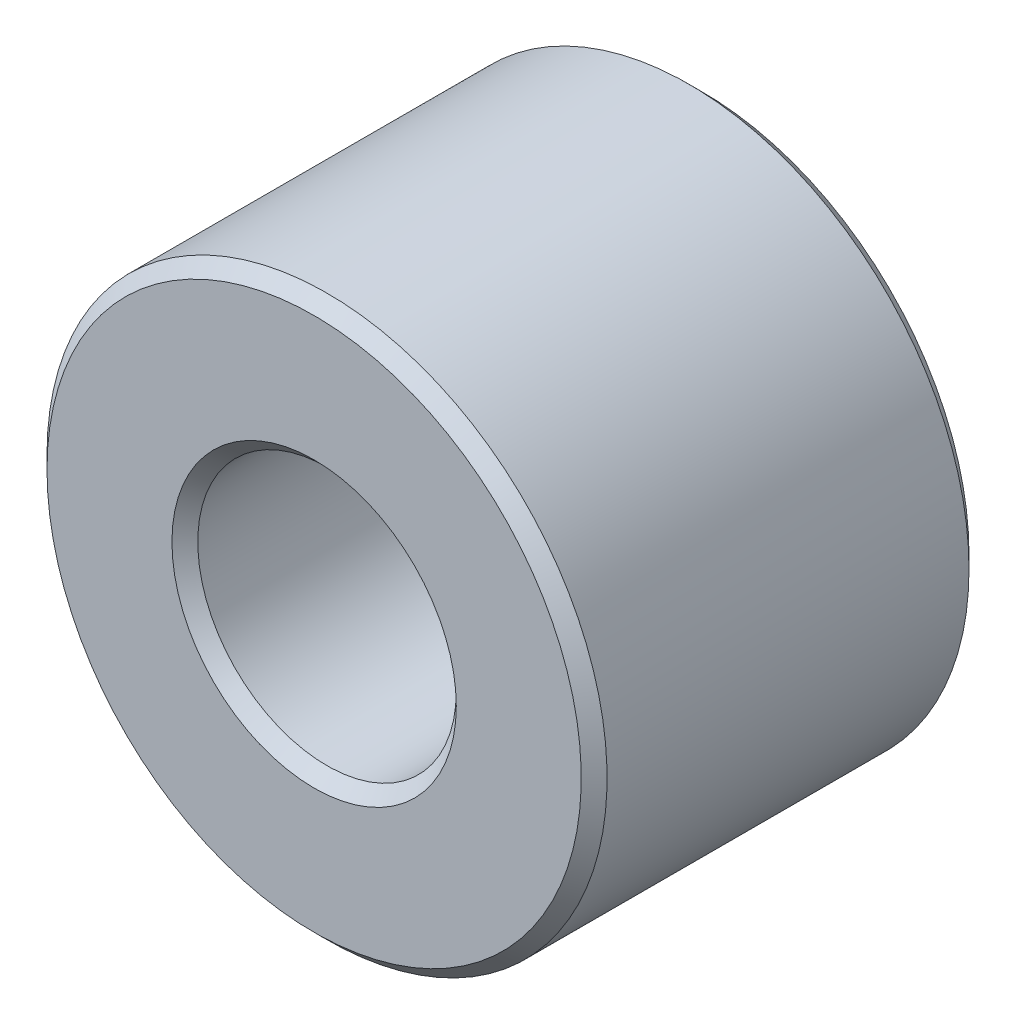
ISO-10303-21;
HEADER;
FILE_DESCRIPTION(('STEP AP214'),'2;1');
FILE_NAME('part.step','',(''),(''),'','','');
FILE_SCHEMA(('AUTOMOTIVE_DESIGN { 1 0 10303 214 1 1 1 1 }'));
ENDSEC;
DATA;
#1=APPLICATION_CONTEXT('core data for automotive mechanical design processes');
#2=APPLICATION_PROTOCOL_DEFINITION('international standard','automotive_design',2000,#1);
#3=PRODUCT_CONTEXT('',#1,'mechanical');
#4=PRODUCT('Part','Part','',(#3));
#5=PRODUCT_RELATED_PRODUCT_CATEGORY('part','',(#4));
#6=PRODUCT_DEFINITION_FORMATION('','',#4);
#7=PRODUCT_DEFINITION_CONTEXT('part definition',#1,'design');
#8=PRODUCT_DEFINITION('design','',#6,#7);
#9=PRODUCT_DEFINITION_SHAPE('','',#8);
#10=(LENGTH_UNIT() NAMED_UNIT(*) SI_UNIT(.MILLI.,.METRE.));
#11=(NAMED_UNIT(*) PLANE_ANGLE_UNIT() SI_UNIT($,.RADIAN.));
#12=(NAMED_UNIT(*) SI_UNIT($,.STERADIAN.) SOLID_ANGLE_UNIT());
#13=UNCERTAINTY_MEASURE_WITH_UNIT(LENGTH_MEASURE(1.E-05),#10,'distance_accuracy_value','');
#14=(GEOMETRIC_REPRESENTATION_CONTEXT(3) GLOBAL_UNCERTAINTY_ASSIGNED_CONTEXT((#13)) GLOBAL_UNIT_ASSIGNED_CONTEXT((#10,
#11,#12)) REPRESENTATION_CONTEXT('',''));
#15=CARTESIAN_POINT('',(0.,0.,0.));
#16=DIRECTION('',(0.,0.,1.));
#17=DIRECTION('',(1.,0.,0.));
#18=AXIS2_PLACEMENT_3D('',#15,#16,#17);
#19=CARTESIAN_POINT('',(0.,0.,9.));
#20=DIRECTION('',(0.,0.,1.));
#21=DIRECTION('',(1.,0.,0.));
#22=AXIS2_PLACEMENT_3D('',#19,#20,#21);
#23=PLANE('',#22);
#24=CARTESIAN_POINT('',(0.,0.,9.));
#25=DIRECTION('',(0.,0.,1.));
#26=DIRECTION('',(1.,0.,0.));
#27=AXIS2_PLACEMENT_3D('',#24,#25,#26);
#28=CIRCLE('',#27,6.6);
#29=CARTESIAN_POINT('',(6.6,0.,9.));
#30=VERTEX_POINT('',#29);
#31=EDGE_CURVE('E10',#30,#30,#28,.F.);
#32=ORIENTED_EDGE('',*,*,#31,.T.);
#33=EDGE_LOOP('',(#32));
#34=FACE_BOUND('',#33,.T.);
#35=CARTESIAN_POINT('',(0.,0.,9.));
#36=DIRECTION('',(0.,0.,1.));
#37=DIRECTION('',(1.,0.,0.));
#38=AXIS2_PLACEMENT_3D('',#35,#36,#37);
#39=CIRCLE('',#38,12.4);
#40=CARTESIAN_POINT('',(-12.4,0.,9.));
#41=VERTEX_POINT('',#40);
#42=EDGE_CURVE('E45',#41,#41,#39,.T.);
#43=ORIENTED_EDGE('',*,*,#42,.T.);
#44=EDGE_LOOP('',(#43));
#45=FACE_BOUND('',#44,.T.);
#46=ADVANCED_FACE('F37',(#34,#45),#23,.T.);
#47=CARTESIAN_POINT('',(0.,0.,-9.));
#48=DIRECTION('',(0.,0.,1.));
#49=DIRECTION('',(1.,0.,0.));
#50=AXIS2_PLACEMENT_3D('',#47,#48,#49);
#51=PLANE('',#50);
#52=CARTESIAN_POINT('',(0.,0.,-9.));
#53=DIRECTION('',(0.,0.,1.));
#54=DIRECTION('',(1.,0.,0.));
#55=AXIS2_PLACEMENT_3D('',#52,#53,#54);
#56=CIRCLE('',#55,6.6);
#57=CARTESIAN_POINT('',(6.6,0.,-9.));
#58=VERTEX_POINT('',#57);
#59=EDGE_CURVE('E70',#58,#58,#56,.T.);
#60=ORIENTED_EDGE('',*,*,#59,.T.);
#61=EDGE_LOOP('',(#60));
#62=FACE_BOUND('',#61,.T.);
#63=CARTESIAN_POINT('',(0.,0.,-9.));
#64=DIRECTION('',(0.,0.,1.));
#65=DIRECTION('',(1.,0.,0.));
#66=AXIS2_PLACEMENT_3D('',#63,#64,#65);
#67=CIRCLE('',#66,12.4);
#68=CARTESIAN_POINT('',(12.4,0.,-9.));
#69=VERTEX_POINT('',#68);
#70=EDGE_CURVE('E74',#69,#69,#67,.F.);
#71=ORIENTED_EDGE('',*,*,#70,.T.);
#72=EDGE_LOOP('',(#71));
#73=FACE_BOUND('',#72,.T.);
#74=ADVANCED_FACE('F78',(#62,#73),#51,.F.);
#75=CARTESIAN_POINT('',(0.,0.,9.));
#76=DIRECTION('',(0.,0.,-1.));
#77=DIRECTION('',(-1.,0.,0.));
#78=AXIS2_PLACEMENT_3D('',#75,#76,#77);
#79=CYLINDRICAL_SURFACE('',#78,13.);
#80=CARTESIAN_POINT('',(0.,0.,-8.4));
#81=DIRECTION('',(0.,0.,1.));
#82=DIRECTION('',(1.,0.,0.));
#83=AXIS2_PLACEMENT_3D('',#80,#81,#82);
#84=CIRCLE('',#83,13.);
#85=CARTESIAN_POINT('',(13.,0.,-8.4));
#86=VERTEX_POINT('',#85);
#87=EDGE_CURVE('E52',#86,#86,#84,.T.);
#88=ORIENTED_EDGE('',*,*,#87,.T.);
#89=EDGE_LOOP('',(#88));
#90=FACE_BOUND('',#89,.T.);
#91=CARTESIAN_POINT('',(0.,0.,8.4));
#92=DIRECTION('',(0.,0.,1.));
#93=DIRECTION('',(1.,0.,0.));
#94=AXIS2_PLACEMENT_3D('',#91,#92,#93);
#95=CIRCLE('',#94,13.);
#96=CARTESIAN_POINT('',(-13.,0.,8.4));
#97=VERTEX_POINT('',#96);
#98=EDGE_CURVE('E58',#97,#97,#95,.F.);
#99=ORIENTED_EDGE('',*,*,#98,.T.);
#100=EDGE_LOOP('',(#99));
#101=FACE_BOUND('',#100,.T.);
#102=ADVANCED_FACE('F88',(#90,#101),#79,.T.);
#103=CARTESIAN_POINT('',(0.,0.,9.));
#104=DIRECTION('',(0.,0.,-1.));
#105=DIRECTION('',(-1.,0.,0.));
#106=AXIS2_PLACEMENT_3D('',#103,#104,#105);
#107=CYLINDRICAL_SURFACE('',#106,6.);
#108=CARTESIAN_POINT('',(0.,0.,-8.4));
#109=DIRECTION('',(0.,0.,1.));
#110=DIRECTION('',(1.,0.,0.));
#111=AXIS2_PLACEMENT_3D('',#108,#109,#110);
#112=CIRCLE('',#111,6.);
#113=CARTESIAN_POINT('',(6.,0.,-8.4));
#114=VERTEX_POINT('',#113);
#115=EDGE_CURVE('E64',#114,#114,#112,.F.);
#116=ORIENTED_EDGE('',*,*,#115,.T.);
#117=EDGE_LOOP('',(#116));
#118=FACE_BOUND('',#117,.T.);
#119=CARTESIAN_POINT('',(0.,0.,8.40000000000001));
#120=DIRECTION('',(0.,0.,1.));
#121=DIRECTION('',(1.,0.,0.));
#122=AXIS2_PLACEMENT_3D('',#119,#120,#121);
#123=CIRCLE('',#122,6.);
#124=CARTESIAN_POINT('',(6.,0.,8.40000000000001));
#125=VERTEX_POINT('',#124);
#126=EDGE_CURVE('E67',#125,#125,#123,.T.);
#127=ORIENTED_EDGE('',*,*,#126,.T.);
#128=EDGE_LOOP('',(#127));
#129=FACE_BOUND('',#128,.T.);
#130=ADVANCED_FACE('F91',(#118,#129),#107,.F.);
#131=CARTESIAN_POINT('',(0.,0.,-9.));
#132=DIRECTION('',(0.,0.,-1.));
#133=DIRECTION('',(-1.,0.,0.));
#134=AXIS2_PLACEMENT_3D('',#131,#132,#133);
#135=CONICAL_SURFACE('',#134,6.6,0.785398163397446);
#136=ORIENTED_EDGE('',*,*,#115,.F.);
#137=EDGE_LOOP('',(#136));
#138=FACE_BOUND('',#137,.T.);
#139=ORIENTED_EDGE('',*,*,#59,.F.);
#140=EDGE_LOOP('',(#139));
#141=FACE_BOUND('',#140,.T.);
#142=ADVANCED_FACE('F84',(#138,#141),#135,.F.);
#143=CARTESIAN_POINT('',(0.,0.,-8.4));
#144=DIRECTION('',(0.,0.,1.));
#145=DIRECTION('',(1.,0.,0.));
#146=AXIS2_PLACEMENT_3D('',#143,#144,#145);
#147=CONICAL_SURFACE('',#146,13.,0.785398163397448);
#148=ORIENTED_EDGE('',*,*,#70,.F.);
#149=EDGE_LOOP('',(#148));
#150=FACE_BOUND('',#149,.T.);
#151=ORIENTED_EDGE('',*,*,#87,.F.);
#152=EDGE_LOOP('',(#151));
#153=FACE_BOUND('',#152,.T.);
#154=ADVANCED_FACE('F80',(#150,#153),#147,.T.);
#155=CARTESIAN_POINT('',(0.,0.,8.40000000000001));
#156=DIRECTION('',(0.,0.,1.));
#157=DIRECTION('',(1.,0.,0.));
#158=AXIS2_PLACEMENT_3D('',#155,#156,#157);
#159=CONICAL_SURFACE('',#158,6.,0.785398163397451);
#160=ORIENTED_EDGE('',*,*,#31,.F.);
#161=EDGE_LOOP('',(#160));
#162=FACE_BOUND('',#161,.T.);
#163=ORIENTED_EDGE('',*,*,#126,.F.);
#164=EDGE_LOOP('',(#163));
#165=FACE_BOUND('',#164,.T.);
#166=ADVANCED_FACE('F83',(#162,#165),#159,.F.);
#167=CARTESIAN_POINT('',(0.,0.,9.));
#168=DIRECTION('',(0.,0.,-1.));
#169=DIRECTION('',(-1.,0.,0.));
#170=AXIS2_PLACEMENT_3D('',#167,#168,#169);
#171=CONICAL_SURFACE('',#170,12.4,0.785398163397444);
#172=CARTESIAN_POINT('',(-13.,0.,8.4));
#173=CARTESIAN_POINT('',(-12.99375,0.,8.40625));
#174=CARTESIAN_POINT('',(-12.9875,0.,8.4125));
#175=CARTESIAN_POINT('',(-12.975,0.,8.425));
#176=CARTESIAN_POINT('',(-12.96875,0.,8.43125));
#177=CARTESIAN_POINT('',(-12.95625,0.,8.44375));
#178=CARTESIAN_POINT('',(-12.95,0.,8.45));
#179=CARTESIAN_POINT('',(-12.9375,0.,8.4625));
#180=CARTESIAN_POINT('',(-12.93125,0.,8.46875));
#181=CARTESIAN_POINT('',(-12.91875,0.,8.48125));
#182=CARTESIAN_POINT('',(-12.9125,0.,8.4875));
#183=CARTESIAN_POINT('',(-12.9,0.,8.5));
#184=CARTESIAN_POINT('',(-12.89375,0.,8.50625));
#185=CARTESIAN_POINT('',(-12.88125,0.,8.51875));
#186=CARTESIAN_POINT('',(-12.875,0.,8.525));
#187=CARTESIAN_POINT('',(-12.8625,0.,8.5375));
#188=CARTESIAN_POINT('',(-12.85625,0.,8.54375));
#189=CARTESIAN_POINT('',(-12.84375,0.,8.55625));
#190=CARTESIAN_POINT('',(-12.8375,0.,8.56249999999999));
#191=CARTESIAN_POINT('',(-12.825,0.,8.575));
#192=CARTESIAN_POINT('',(-12.81875,0.,8.58125));
#193=CARTESIAN_POINT('',(-12.80625,0.,8.59375));
#194=CARTESIAN_POINT('',(-12.8,0.,8.6));
#195=CARTESIAN_POINT('',(-12.7875,0.,8.6125));
#196=CARTESIAN_POINT('',(-12.78125,0.,8.61875));
#197=CARTESIAN_POINT('',(-12.76875,0.,8.63125));
#198=CARTESIAN_POINT('',(-12.7625,0.,8.6375));
#199=CARTESIAN_POINT('',(-12.75,0.,8.65));
#200=CARTESIAN_POINT('',(-12.74375,0.,8.65625));
#201=CARTESIAN_POINT('',(-12.73125,0.,8.66875));
#202=CARTESIAN_POINT('',(-12.725,0.,8.675));
#203=CARTESIAN_POINT('',(-12.7125,0.,8.6875));
#204=CARTESIAN_POINT('',(-12.70625,0.,8.69375));
#205=CARTESIAN_POINT('',(-12.69375,0.,8.70625));
#206=CARTESIAN_POINT('',(-12.6875,0.,8.7125));
#207=CARTESIAN_POINT('',(-12.675,0.,8.725));
#208=CARTESIAN_POINT('',(-12.66875,0.,8.73125));
#209=CARTESIAN_POINT('',(-12.65625,0.,8.74375));
#210=CARTESIAN_POINT('',(-12.65,0.,8.75));
#211=CARTESIAN_POINT('',(-12.6375,0.,8.7625));
#212=CARTESIAN_POINT('',(-12.63125,0.,8.76875));
#213=CARTESIAN_POINT('',(-12.61875,0.,8.78125));
#214=CARTESIAN_POINT('',(-12.6125,0.,8.7875));
#215=CARTESIAN_POINT('',(-12.6,0.,8.8));
#216=CARTESIAN_POINT('',(-12.59375,0.,8.80625));
#217=CARTESIAN_POINT('',(-12.58125,0.,8.81875));
#218=CARTESIAN_POINT('',(-12.575,0.,8.825));
#219=CARTESIAN_POINT('',(-12.5625,0.,8.8375));
#220=CARTESIAN_POINT('',(-12.55625,0.,8.84375));
#221=CARTESIAN_POINT('',(-12.54375,0.,8.85625));
#222=CARTESIAN_POINT('',(-12.5375,0.,8.8625));
#223=CARTESIAN_POINT('',(-12.525,0.,8.875));
#224=CARTESIAN_POINT('',(-12.51875,0.,8.88125));
#225=CARTESIAN_POINT('',(-12.50625,0.,8.89375));
#226=CARTESIAN_POINT('',(-12.5,0.,8.9));
#227=CARTESIAN_POINT('',(-12.4875,0.,8.9125));
#228=CARTESIAN_POINT('',(-12.48125,0.,8.91875));
#229=CARTESIAN_POINT('',(-12.46875,0.,8.93125));
#230=CARTESIAN_POINT('',(-12.4625,0.,8.9375));
#231=CARTESIAN_POINT('',(-12.45,0.,8.95));
#232=CARTESIAN_POINT('',(-12.44375,0.,8.95625));
#233=CARTESIAN_POINT('',(-12.43125,0.,8.96875));
#234=CARTESIAN_POINT('',(-12.425,0.,8.975));
#235=CARTESIAN_POINT('',(-12.4125,0.,8.9875));
#236=CARTESIAN_POINT('',(-12.40625,0.,8.99375));
#237=CARTESIAN_POINT('',(-12.4,0.,9.));
#238=B_SPLINE_CURVE_WITH_KNOTS('',3,(#172,#173,#174,#175,#176,#177,#178,#179,#180,#181,#182,
#183,#184,#185,#186,#187,#188,#189,#190,#191,#192,#193,#194,#195,#196,#197,#198,#199,#200,#201,
#202,#203,#204,#205,#206,#207,#208,#209,#210,#211,#212,#213,#214,#215,#216,#217,#218,#219,#220,
#221,#222,#223,#224,#225,#226,#227,#228,#229,#230,#231,#232,#233,#234,#235,#236,#237),
.UNSPECIFIED.,.F.,.F.,(4,2,2,2,2,2,2,2,2,2,2,2,2,2,2,2,2,2,2,2,2,2,2,2,2,2,2,2,2,2,2,2,4),(0.,
0.0265165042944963,0.0530330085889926,0.0795495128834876,0.106066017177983,0.132582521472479,
0.159099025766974,0.185615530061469,0.212132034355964,0.238648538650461,0.265165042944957,
0.291681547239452,0.318198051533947,0.344714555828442,0.371231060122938,0.397747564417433,
0.424264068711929,0.450780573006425,0.47729707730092,0.503813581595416,0.530330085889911,
0.556846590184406,0.583363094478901,0.609879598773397,0.636396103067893,0.662912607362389,
0.689429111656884,0.715945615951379,0.742462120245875,0.76897862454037,0.795495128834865,
0.82201163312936,0.848528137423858),.UNSPECIFIED.);
#239=EDGE_CURVE('BSEAM39',#97,#41,#238,.T.);
#240=ORIENTED_EDGE('',*,*,#98,.F.);
#241=ORIENTED_EDGE('',*,*,#42,.F.);
#242=ORIENTED_EDGE('',*,*,#239,.T.);
#243=ORIENTED_EDGE('',*,*,#239,.F.);
#244=EDGE_LOOP('',(#240,#242,#241,#243));
#245=FACE_BOUND('',#244,.T.);
#246=ADVANCED_FACE('F39',(#245),#171,.T.);
#247=CLOSED_SHELL('',(#46,#74,#102,#130,#142,#154,#166,#246));
#248=MANIFOLD_SOLID_BREP('B2',#247);
#249=ADVANCED_BREP_SHAPE_REPRESENTATION('',(#18,#248),#14);
#250=SHAPE_DEFINITION_REPRESENTATION(#9,#249);
ENDSEC;
END-ISO-10303-21;
